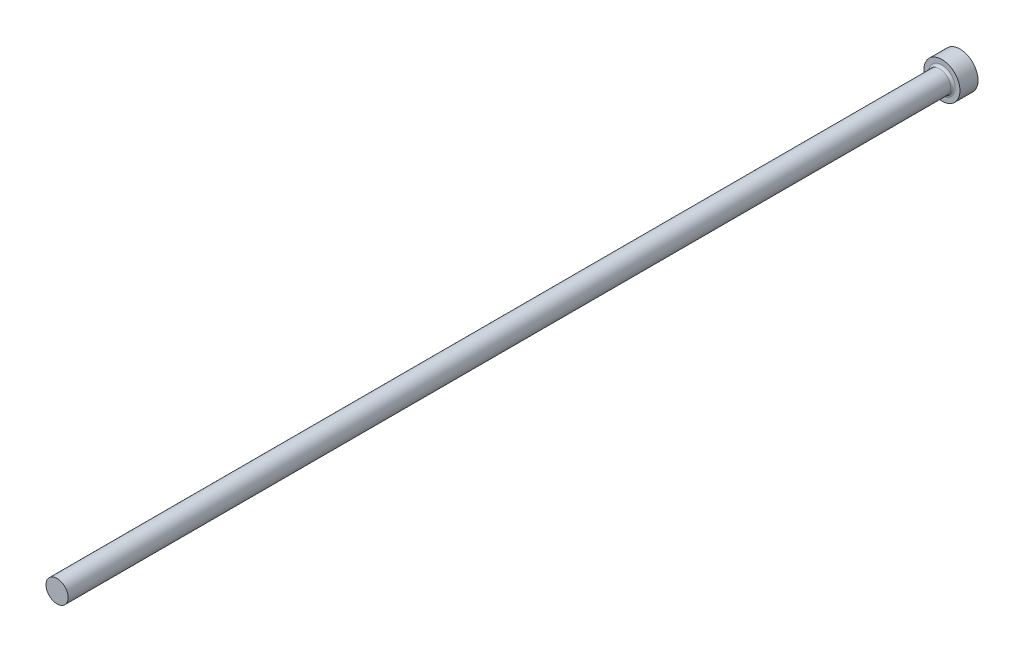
from build123d import *

# Parameters (mm, degrees)
FILLET1_R = 0.5


with BuildPart() as part:
    # FV → Revolve1 (revolve)
    with BuildSketch(Plane(origin=(0, 0, 0), x_dir=(1, 0, 0), z_dir=(0, 1, 0)), mode=Mode.PRIVATE) as revolve1_sk:
        Polygon((0, 0), (4, 0), (4, -4), (2.45, -4), (2.45, -200), (0, -200), align=None)
    revolve(revolve1_sk.sketch.rotate(Axis((0, 0, -9.033228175), (0, 0, 1)), 180), axis=Axis((0, 0, -9.033228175), (0, 0, 1)))

    # Fillet1
    fillet1_edges = [part.edges().sort_by_distance(p)[0] for p in [
        (2.45, 0, 4),
    ]]
    fillet(fillet1_edges, radius=FILLET1_R)


solid = part.part
